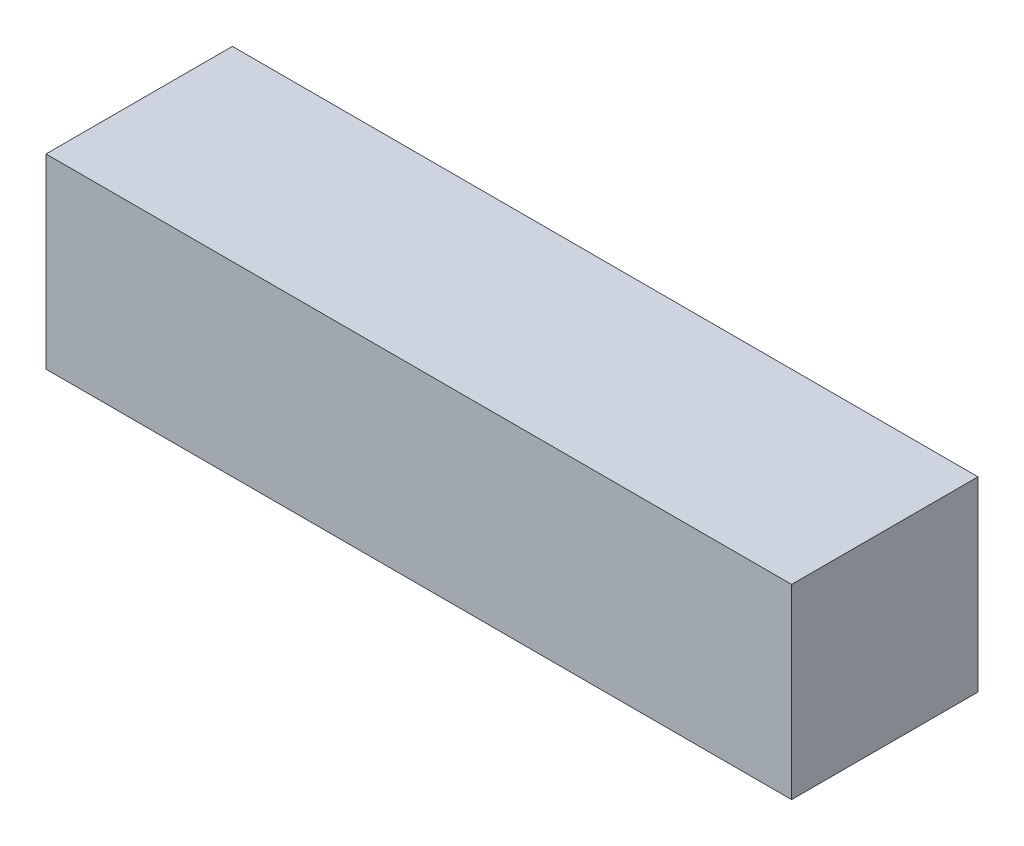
from build123d import *

# Parameters (mm, degrees)
ESQUISSE1_W      = 12
ESQUISSE1_H      = 3
EXTRUSION1_DEPTH = 1.5


with BuildPart() as part:
    # Esquisse1 → Extrusion1 (new, symmetric)
    with BuildSketch(Plane.XY):
        Rectangle(ESQUISSE1_W, ESQUISSE1_H)
    extrude(amount=EXTRUSION1_DEPTH, both=True)


solid = part.part
